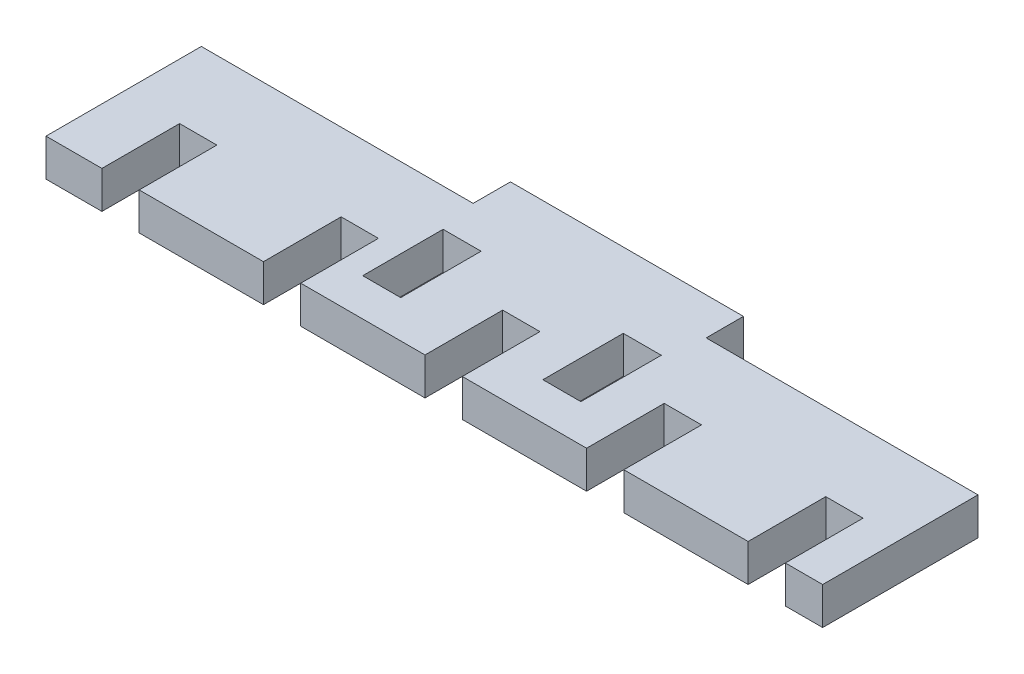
from build123d import *

# Parameters (mm, degrees)
SKETCH1_W           = 1.553624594
SKETCH1_H           = 3.285366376
BOSS_EXTRUDE1_DEPTH = 1.524


with BuildPart() as part:
    # Sketch1 → Boss-Extrude1 (new body)
    with BuildSketch(Plane(origin=(0, 0, 0), x_dir=(1, 0, 0), z_dir=(0, 1, 0))):
        Polygon((19.1135, -3.175), (19.1135, -6.35), (20.6375, -6.35), (20.6375, 0), (9.525, 0), (9.525, 1.524), (0, 1.524), (0, 0), (-11.1125, 0), (-11.1125, -6.35), (-8.8265, -6.35), (-8.8265, -3.175), (-7.3025, -3.175), (-7.3025, -6.35), (-2.2225, -6.35), (-2.2225, -3.175), (-0.6985, -3.175), (-0.6985, -6.35), (4.3815, -6.35), (4.3815, -3.175), (5.9055, -3.175), (5.9055, -6.35), (10.9855, -6.35), (10.9855, -3.175), (12.5095, -3.175), (12.5095, -6.35), (17.5895, -6.35), (17.5895, -3.175), align=None)
        with Locations((8.4455, -3.175)):
            Rectangle(SKETCH1_W, SKETCH1_H, mode=Mode.SUBTRACT)
        with Locations((1.0795, -3.175)):
            Rectangle(SKETCH1_W, SKETCH1_H, mode=Mode.SUBTRACT)
    extrude(amount=BOSS_EXTRUDE1_DEPTH)


solid = part.part
